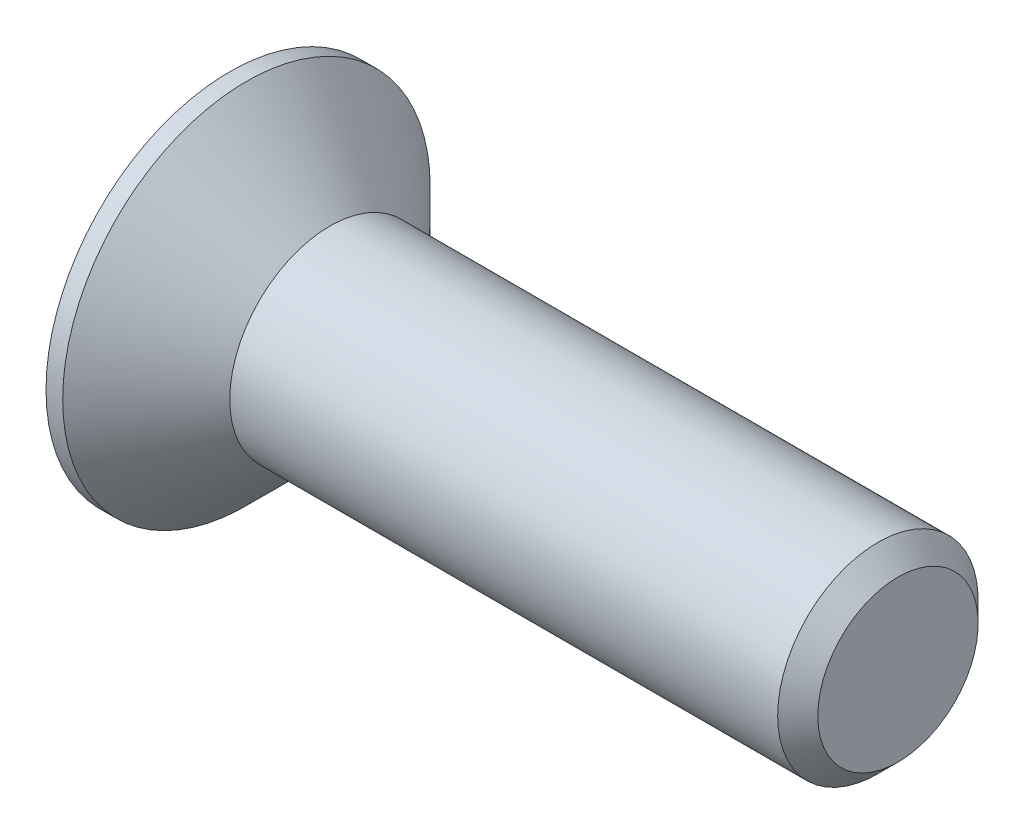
ISO-10303-21;
HEADER;
FILE_DESCRIPTION(('STEP AP214'),'2;1');
FILE_NAME('part.step','',(''),(''),'','','');
FILE_SCHEMA(('AUTOMOTIVE_DESIGN { 1 0 10303 214 1 1 1 1 }'));
ENDSEC;
DATA;
#1=APPLICATION_CONTEXT('core data for automotive mechanical design processes');
#2=APPLICATION_PROTOCOL_DEFINITION('international standard','automotive_design',2000,#1);
#3=PRODUCT_CONTEXT('',#1,'mechanical');
#4=PRODUCT('Part','Part','',(#3));
#5=PRODUCT_RELATED_PRODUCT_CATEGORY('part','',(#4));
#6=PRODUCT_DEFINITION_FORMATION('','',#4);
#7=PRODUCT_DEFINITION_CONTEXT('part definition',#1,'design');
#8=PRODUCT_DEFINITION('design','',#6,#7);
#9=PRODUCT_DEFINITION_SHAPE('','',#8);
#10=(LENGTH_UNIT() NAMED_UNIT(*) SI_UNIT(.MILLI.,.METRE.));
#11=(NAMED_UNIT(*) PLANE_ANGLE_UNIT() SI_UNIT($,.RADIAN.));
#12=(NAMED_UNIT(*) SI_UNIT($,.STERADIAN.) SOLID_ANGLE_UNIT());
#13=UNCERTAINTY_MEASURE_WITH_UNIT(LENGTH_MEASURE(1.E-05),#10,'distance_accuracy_value','');
#14=(GEOMETRIC_REPRESENTATION_CONTEXT(3) GLOBAL_UNCERTAINTY_ASSIGNED_CONTEXT((#13)) GLOBAL_UNIT_ASSIGNED_CONTEXT((#10,
#11,#12)) REPRESENTATION_CONTEXT('',''));
#15=CARTESIAN_POINT('',(0.,0.,0.));
#16=DIRECTION('',(0.,0.,1.));
#17=DIRECTION('',(1.,0.,0.));
#18=AXIS2_PLACEMENT_3D('',#15,#16,#17);
#19=CARTESIAN_POINT('',(0.,0.,0.));
#20=DIRECTION('',(-1.,0.,0.));
#21=DIRECTION('',(0.,0.,1.));
#22=AXIS2_PLACEMENT_3D('',#19,#20,#21);
#23=CONICAL_SURFACE('',#22,3.,0.78539816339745);
#24=CARTESIAN_POINT('',(-2.49999999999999,0.,0.));
#25=DIRECTION('',(-1.,0.,0.));
#26=DIRECTION('',(0.,0.,1.));
#27=AXIS2_PLACEMENT_3D('',#24,#25,#26);
#28=CIRCLE('',#27,5.5);
#29=CARTESIAN_POINT('',(-2.49999999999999,0.,5.5));
#30=VERTEX_POINT('',#29);
#31=EDGE_CURVE('E189',#30,#30,#28,.T.);
#32=ORIENTED_EDGE('',*,*,#31,.F.);
#33=EDGE_LOOP('',(#32));
#34=FACE_BOUND('',#33,.T.);
#35=CARTESIAN_POINT('',(0.,0.,0.));
#36=DIRECTION('',(-1.,0.,0.));
#37=DIRECTION('',(0.,0.,1.));
#38=AXIS2_PLACEMENT_3D('',#35,#36,#37);
#39=CIRCLE('',#38,3.);
#40=CARTESIAN_POINT('',(0.,0.,3.));
#41=VERTEX_POINT('',#40);
#42=EDGE_CURVE('E212',#41,#41,#39,.T.);
#43=ORIENTED_EDGE('',*,*,#42,.T.);
#44=EDGE_LOOP('',(#43));
#45=FACE_BOUND('',#44,.T.);
#46=ADVANCED_FACE('F33',(#34,#45),#23,.T.);
#47=CARTESIAN_POINT('',(-3.,0.,0.));
#48=DIRECTION('',(-1.,0.,0.));
#49=DIRECTION('',(0.,0.,1.));
#50=AXIS2_PLACEMENT_3D('',#47,#48,#49);
#51=CYLINDRICAL_SURFACE('',#50,3.);
#52=CARTESIAN_POINT('',(16.4,0.,0.));
#53=DIRECTION('',(-1.,0.,0.));
#54=DIRECTION('',(0.,0.,1.));
#55=AXIS2_PLACEMENT_3D('',#52,#53,#54);
#56=CIRCLE('',#55,3.);
#57=CARTESIAN_POINT('',(16.4,0.,3.));
#58=VERTEX_POINT('',#57);
#59=EDGE_CURVE('E41',#58,#58,#56,.T.);
#60=ORIENTED_EDGE('',*,*,#59,.T.);
#61=EDGE_LOOP('',(#60));
#62=FACE_BOUND('',#61,.T.);
#63=ORIENTED_EDGE('',*,*,#42,.F.);
#64=EDGE_LOOP('',(#63));
#65=FACE_BOUND('',#64,.T.);
#66=ADVANCED_FACE('F217',(#62,#65),#51,.T.);
#67=CARTESIAN_POINT('',(17.,0.,0.));
#68=DIRECTION('',(-1.,0.,0.));
#69=DIRECTION('',(0.,0.,1.));
#70=AXIS2_PLACEMENT_3D('',#67,#68,#69);
#71=PLANE('',#70);
#72=CARTESIAN_POINT('',(17.,0.,0.));
#73=DIRECTION('',(-1.,0.,0.));
#74=DIRECTION('',(0.,0.,1.));
#75=AXIS2_PLACEMENT_3D('',#72,#73,#74);
#76=CIRCLE('',#75,2.39999999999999);
#77=CARTESIAN_POINT('',(17.,0.,2.39999999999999));
#78=VERTEX_POINT('',#77);
#79=EDGE_CURVE('E11',#78,#78,#76,.F.);
#80=ORIENTED_EDGE('',*,*,#79,.T.);
#81=EDGE_LOOP('',(#80));
#82=FACE_BOUND('',#81,.T.);
#83=ADVANCED_FACE('F239',(#82),#71,.F.);
#84=CARTESIAN_POINT('',(-3.,5.5,0.));
#85=DIRECTION('',(1.,0.,0.));
#86=DIRECTION('',(0.,0.,-1.));
#87=AXIS2_PLACEMENT_3D('',#84,#85,#86);
#88=PLANE('',#87);
#89=DIRECTION('',(0.,0.,-1.));
#90=VECTOR('',#89,1.);
#91=CARTESIAN_POINT('',(-3.,0.825,-3.3));
#92=LINE('',#91,#90);
#93=CARTESIAN_POINT('',(-3.,0.825,-0.825));
#94=VERTEX_POINT('',#93);
#95=CARTESIAN_POINT('',(-3.,0.825,-3.3));
#96=VERTEX_POINT('',#95);
#97=EDGE_CURVE('E158',#94,#96,#92,.T.);
#98=ORIENTED_EDGE('',*,*,#97,.F.);
#99=DIRECTION('',(0.,-1.,0.));
#100=VECTOR('',#99,1.);
#101=CARTESIAN_POINT('',(-3.,0.825,-0.825));
#102=LINE('',#101,#100);
#103=CARTESIAN_POINT('',(-3.,3.3,-0.825));
#104=VERTEX_POINT('',#103);
#105=EDGE_CURVE('E48',#104,#94,#102,.T.);
#106=ORIENTED_EDGE('',*,*,#105,.F.);
#107=DIRECTION('',(0.,0.,-1.));
#108=VECTOR('',#107,1.);
#109=CARTESIAN_POINT('',(-3.,3.3,-0.825));
#110=LINE('',#109,#108);
#111=CARTESIAN_POINT('',(-3.,3.3,0.825));
#112=VERTEX_POINT('',#111);
#113=EDGE_CURVE('E185',#112,#104,#110,.T.);
#114=ORIENTED_EDGE('',*,*,#113,.F.);
#115=DIRECTION('',(0.,1.,0.));
#116=VECTOR('',#115,1.);
#117=CARTESIAN_POINT('',(-3.,3.3,0.825));
#118=LINE('',#117,#116);
#119=CARTESIAN_POINT('',(-3.,0.825,0.825));
#120=VERTEX_POINT('',#119);
#121=EDGE_CURVE('E183',#120,#112,#118,.T.);
#122=ORIENTED_EDGE('',*,*,#121,.F.);
#123=DIRECTION('',(0.,0.,-1.));
#124=VECTOR('',#123,1.);
#125=CARTESIAN_POINT('',(-3.,0.825,0.825));
#126=LINE('',#125,#124);
#127=CARTESIAN_POINT('',(-3.,0.825,3.3));
#128=VERTEX_POINT('',#127);
#129=EDGE_CURVE('E132',#128,#120,#126,.T.);
#130=ORIENTED_EDGE('',*,*,#129,.F.);
#131=DIRECTION('',(0.,1.,0.));
#132=VECTOR('',#131,1.);
#133=CARTESIAN_POINT('',(-3.,0.825,3.3));
#134=LINE('',#133,#132);
#135=CARTESIAN_POINT('',(-3.,-0.825,3.3));
#136=VERTEX_POINT('',#135);
#137=EDGE_CURVE('E179',#136,#128,#134,.T.);
#138=ORIENTED_EDGE('',*,*,#137,.F.);
#139=DIRECTION('',(0.,0.,1.));
#140=VECTOR('',#139,1.);
#141=CARTESIAN_POINT('',(-3.,-0.825,3.3));
#142=LINE('',#141,#140);
#143=CARTESIAN_POINT('',(-3.,-0.825,0.825));
#144=VERTEX_POINT('',#143);
#145=EDGE_CURVE('E176',#144,#136,#142,.T.);
#146=ORIENTED_EDGE('',*,*,#145,.F.);
#147=DIRECTION('',(0.,1.,0.));
#148=VECTOR('',#147,1.);
#149=CARTESIAN_POINT('',(-3.,-0.825,0.825));
#150=LINE('',#149,#148);
#151=CARTESIAN_POINT('',(-3.,-3.3,0.825));
#152=VERTEX_POINT('',#151);
#153=EDGE_CURVE('E173',#152,#144,#150,.T.);
#154=ORIENTED_EDGE('',*,*,#153,.F.);
#155=DIRECTION('',(0.,0.,1.));
#156=VECTOR('',#155,1.);
#157=CARTESIAN_POINT('',(-3.,-3.3,0.825));
#158=LINE('',#157,#156);
#159=CARTESIAN_POINT('',(-3.,-3.3,-0.825));
#160=VERTEX_POINT('',#159);
#161=EDGE_CURVE('E170',#160,#152,#158,.T.);
#162=ORIENTED_EDGE('',*,*,#161,.F.);
#163=DIRECTION('',(0.,-1.,0.));
#164=VECTOR('',#163,1.);
#165=CARTESIAN_POINT('',(-3.,-3.3,-0.825));
#166=LINE('',#165,#164);
#167=CARTESIAN_POINT('',(-3.,-0.825,-0.825));
#168=VERTEX_POINT('',#167);
#169=EDGE_CURVE('E167',#168,#160,#166,.T.);
#170=ORIENTED_EDGE('',*,*,#169,.F.);
#171=DIRECTION('',(0.,0.,1.));
#172=VECTOR('',#171,1.);
#173=CARTESIAN_POINT('',(-3.,-0.825,-0.825));
#174=LINE('',#173,#172);
#175=CARTESIAN_POINT('',(-3.,-0.825,-3.3));
#176=VERTEX_POINT('',#175);
#177=EDGE_CURVE('E164',#176,#168,#174,.T.);
#178=ORIENTED_EDGE('',*,*,#177,.F.);
#179=DIRECTION('',(0.,-1.,0.));
#180=VECTOR('',#179,1.);
#181=CARTESIAN_POINT('',(-3.,-0.825,-3.3));
#182=LINE('',#181,#180);
#183=EDGE_CURVE('E161',#96,#176,#182,.T.);
#184=ORIENTED_EDGE('',*,*,#183,.F.);
#185=EDGE_LOOP('',(#98,#106,#114,#122,#130,#138,#146,#154,#162,#170,#178,#184));
#186=FACE_BOUND('',#185,.T.);
#187=CARTESIAN_POINT('',(-3.,0.,0.));
#188=DIRECTION('',(-1.,0.,0.));
#189=DIRECTION('',(0.,0.,1.));
#190=AXIS2_PLACEMENT_3D('',#187,#188,#189);
#191=CIRCLE('',#190,5.5);
#192=CARTESIAN_POINT('',(-3.,0.,5.5));
#193=VERTEX_POINT('',#192);
#194=EDGE_CURVE('E209',#193,#193,#191,.T.);
#195=ORIENTED_EDGE('',*,*,#194,.T.);
#196=EDGE_LOOP('',(#195));
#197=FACE_BOUND('',#196,.T.);
#198=ADVANCED_FACE('F230',(#186,#197),#88,.F.);
#199=CARTESIAN_POINT('',(-3.,0.,0.));
#200=DIRECTION('',(-1.,0.,0.));
#201=DIRECTION('',(0.,0.,1.));
#202=AXIS2_PLACEMENT_3D('',#199,#200,#201);
#203=CYLINDRICAL_SURFACE('',#202,5.5);
#204=ORIENTED_EDGE('',*,*,#194,.F.);
#205=EDGE_LOOP('',(#204));
#206=FACE_BOUND('',#205,.T.);
#207=ORIENTED_EDGE('',*,*,#31,.T.);
#208=EDGE_LOOP('',(#207));
#209=FACE_BOUND('',#208,.T.);
#210=ADVANCED_FACE('F222',(#206,#209),#203,.T.);
#211=CARTESIAN_POINT('',(16.4,0.,0.));
#212=DIRECTION('',(-1.,0.,0.));
#213=DIRECTION('',(0.,0.,1.));
#214=AXIS2_PLACEMENT_3D('',#211,#212,#213);
#215=CONICAL_SURFACE('',#214,3.,0.785398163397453);
#216=ORIENTED_EDGE('',*,*,#79,.F.);
#217=EDGE_LOOP('',(#216));
#218=FACE_BOUND('',#217,.T.);
#219=ORIENTED_EDGE('',*,*,#59,.F.);
#220=EDGE_LOOP('',(#219));
#221=FACE_BOUND('',#220,.T.);
#222=ADVANCED_FACE('F35',(#218,#221),#215,.T.);
#223=CARTESIAN_POINT('',(-0.5,0.825,-0.825));
#224=DIRECTION('',(0.,0.,-1.));
#225=DIRECTION('',(-1.,0.,0.));
#226=AXIS2_PLACEMENT_3D('',#223,#224,#225);
#227=PLANE('',#226);
#228=ORIENTED_EDGE('',*,*,#105,.T.);
#229=DIRECTION('',(-1.,0.,0.));
#230=VECTOR('',#229,1.);
#231=CARTESIAN_POINT('',(-0.5,0.825,-0.825));
#232=LINE('',#231,#230);
#233=CARTESIAN_POINT('',(-0.5,0.825,-0.825));
#234=VERTEX_POINT('',#233);
#235=EDGE_CURVE('E96',#234,#94,#232,.T.);
#236=ORIENTED_EDGE('',*,*,#235,.F.);
#237=DIRECTION('',(0.,-1.,0.));
#238=VECTOR('',#237,1.);
#239=CARTESIAN_POINT('',(-0.5,0.825,-0.825));
#240=LINE('',#239,#238);
#241=CARTESIAN_POINT('',(-0.5,3.3,-0.825));
#242=VERTEX_POINT('',#241);
#243=EDGE_CURVE('E187',#242,#234,#240,.T.);
#244=ORIENTED_EDGE('',*,*,#243,.F.);
#245=DIRECTION('',(-1.,0.,0.));
#246=VECTOR('',#245,1.);
#247=CARTESIAN_POINT('',(-0.5,3.3,-0.825));
#248=LINE('',#247,#246);
#249=EDGE_CURVE('E56',#242,#104,#248,.T.);
#250=ORIENTED_EDGE('',*,*,#249,.T.);
#251=EDGE_LOOP('',(#228,#236,#244,#250));
#252=FACE_BOUND('',#251,.T.);
#253=ADVANCED_FACE('F221',(#252),#227,.F.);
#254=CARTESIAN_POINT('',(-0.5,3.3,-0.825));
#255=DIRECTION('',(0.,1.,0.));
#256=DIRECTION('',(-1.,0.,0.));
#257=AXIS2_PLACEMENT_3D('',#254,#255,#256);
#258=PLANE('',#257);
#259=ORIENTED_EDGE('',*,*,#113,.T.);
#260=ORIENTED_EDGE('',*,*,#249,.F.);
#261=DIRECTION('',(0.,0.,-1.));
#262=VECTOR('',#261,1.);
#263=CARTESIAN_POINT('',(-0.5,3.3,-0.825));
#264=LINE('',#263,#262);
#265=CARTESIAN_POINT('',(-0.5,3.3,0.825));
#266=VERTEX_POINT('',#265);
#267=EDGE_CURVE('E144',#266,#242,#264,.T.);
#268=ORIENTED_EDGE('',*,*,#267,.F.);
#269=DIRECTION('',(-1.,0.,0.));
#270=VECTOR('',#269,1.);
#271=CARTESIAN_POINT('',(-0.5,3.3,0.825));
#272=LINE('',#271,#270);
#273=EDGE_CURVE('E136',#266,#112,#272,.T.);
#274=ORIENTED_EDGE('',*,*,#273,.T.);
#275=EDGE_LOOP('',(#259,#260,#268,#274));
#276=FACE_BOUND('',#275,.T.);
#277=ADVANCED_FACE('F228',(#276),#258,.F.);
#278=CARTESIAN_POINT('',(-0.5,3.3,0.825));
#279=DIRECTION('',(0.,0.,1.));
#280=DIRECTION('',(1.,0.,0.));
#281=AXIS2_PLACEMENT_3D('',#278,#279,#280);
#282=PLANE('',#281);
#283=ORIENTED_EDGE('',*,*,#121,.T.);
#284=ORIENTED_EDGE('',*,*,#273,.F.);
#285=DIRECTION('',(0.,1.,0.));
#286=VECTOR('',#285,1.);
#287=CARTESIAN_POINT('',(-0.5,3.3,0.825));
#288=LINE('',#287,#286);
#289=CARTESIAN_POINT('',(-0.5,0.825,0.825));
#290=VERTEX_POINT('',#289);
#291=EDGE_CURVE('E140',#290,#266,#288,.T.);
#292=ORIENTED_EDGE('',*,*,#291,.F.);
#293=DIRECTION('',(-1.,0.,0.));
#294=VECTOR('',#293,1.);
#295=CARTESIAN_POINT('',(-0.5,0.825,0.825));
#296=LINE('',#295,#294);
#297=EDGE_CURVE('E125',#290,#120,#296,.T.);
#298=ORIENTED_EDGE('',*,*,#297,.T.);
#299=EDGE_LOOP('',(#283,#284,#292,#298));
#300=FACE_BOUND('',#299,.T.);
#301=ADVANCED_FACE('F141',(#300),#282,.F.);
#302=CARTESIAN_POINT('',(-0.5,0.825,0.825));
#303=DIRECTION('',(0.,1.,0.));
#304=DIRECTION('',(-1.,0.,0.));
#305=AXIS2_PLACEMENT_3D('',#302,#303,#304);
#306=PLANE('',#305);
#307=ORIENTED_EDGE('',*,*,#129,.T.);
#308=ORIENTED_EDGE('',*,*,#297,.F.);
#309=DIRECTION('',(0.,0.,-1.));
#310=VECTOR('',#309,1.);
#311=CARTESIAN_POINT('',(-0.5,0.825,0.825));
#312=LINE('',#311,#310);
#313=CARTESIAN_POINT('',(-0.5,0.825,3.3));
#314=VERTEX_POINT('',#313);
#315=EDGE_CURVE('E129',#314,#290,#312,.T.);
#316=ORIENTED_EDGE('',*,*,#315,.F.);
#317=DIRECTION('',(-1.,0.,0.));
#318=VECTOR('',#317,1.);
#319=CARTESIAN_POINT('',(-0.5,0.825,3.3));
#320=LINE('',#319,#318);
#321=EDGE_CURVE('E137',#314,#128,#320,.T.);
#322=ORIENTED_EDGE('',*,*,#321,.T.);
#323=EDGE_LOOP('',(#307,#308,#316,#322));
#324=FACE_BOUND('',#323,.T.);
#325=ADVANCED_FACE('F127',(#324),#306,.F.);
#326=CARTESIAN_POINT('',(-0.5,0.825,3.3));
#327=DIRECTION('',(0.,0.,1.));
#328=DIRECTION('',(1.,0.,0.));
#329=AXIS2_PLACEMENT_3D('',#326,#327,#328);
#330=PLANE('',#329);
#331=ORIENTED_EDGE('',*,*,#137,.T.);
#332=ORIENTED_EDGE('',*,*,#321,.F.);
#333=DIRECTION('',(0.,1.,0.));
#334=VECTOR('',#333,1.);
#335=CARTESIAN_POINT('',(-0.5,0.825,3.3));
#336=LINE('',#335,#334);
#337=CARTESIAN_POINT('',(-0.5,-0.825,3.3));
#338=VERTEX_POINT('',#337);
#339=EDGE_CURVE('E150',#338,#314,#336,.T.);
#340=ORIENTED_EDGE('',*,*,#339,.F.);
#341=DIRECTION('',(-1.,0.,0.));
#342=VECTOR('',#341,1.);
#343=CARTESIAN_POINT('',(-0.5,-0.825,3.3));
#344=LINE('',#343,#342);
#345=EDGE_CURVE('E192',#338,#136,#344,.T.);
#346=ORIENTED_EDGE('',*,*,#345,.T.);
#347=EDGE_LOOP('',(#331,#332,#340,#346));
#348=FACE_BOUND('',#347,.T.);
#349=ADVANCED_FACE('F277',(#348),#330,.F.);
#350=CARTESIAN_POINT('',(-0.5,-0.825,3.3));
#351=DIRECTION('',(0.,-1.,0.));
#352=DIRECTION('',(1.,0.,0.));
#353=AXIS2_PLACEMENT_3D('',#350,#351,#352);
#354=PLANE('',#353);
#355=ORIENTED_EDGE('',*,*,#145,.T.);
#356=ORIENTED_EDGE('',*,*,#345,.F.);
#357=DIRECTION('',(0.,0.,1.));
#358=VECTOR('',#357,1.);
#359=CARTESIAN_POINT('',(-0.5,-0.825,3.3));
#360=LINE('',#359,#358);
#361=CARTESIAN_POINT('',(-0.5,-0.825,0.825));
#362=VERTEX_POINT('',#361);
#363=EDGE_CURVE('E152',#362,#338,#360,.T.);
#364=ORIENTED_EDGE('',*,*,#363,.F.);
#365=DIRECTION('',(-1.,0.,0.));
#366=VECTOR('',#365,1.);
#367=CARTESIAN_POINT('',(-0.5,-0.825,0.825));
#368=LINE('',#367,#366);
#369=EDGE_CURVE('E194',#362,#144,#368,.T.);
#370=ORIENTED_EDGE('',*,*,#369,.T.);
#371=EDGE_LOOP('',(#355,#356,#364,#370));
#372=FACE_BOUND('',#371,.T.);
#373=ADVANCED_FACE('F273',(#372),#354,.F.);
#374=CARTESIAN_POINT('',(-0.5,-0.825,0.825));
#375=DIRECTION('',(0.,0.,1.));
#376=DIRECTION('',(1.,0.,0.));
#377=AXIS2_PLACEMENT_3D('',#374,#375,#376);
#378=PLANE('',#377);
#379=ORIENTED_EDGE('',*,*,#153,.T.);
#380=ORIENTED_EDGE('',*,*,#369,.F.);
#381=DIRECTION('',(0.,1.,0.));
#382=VECTOR('',#381,1.);
#383=CARTESIAN_POINT('',(-0.5,-0.825,0.825));
#384=LINE('',#383,#382);
#385=CARTESIAN_POINT('',(-0.5,-3.3,0.825));
#386=VERTEX_POINT('',#385);
#387=EDGE_CURVE('E422',#386,#362,#384,.T.);
#388=ORIENTED_EDGE('',*,*,#387,.F.);
#389=DIRECTION('',(-1.,0.,0.));
#390=VECTOR('',#389,1.);
#391=CARTESIAN_POINT('',(-0.5,-3.3,0.825));
#392=LINE('',#391,#390);
#393=EDGE_CURVE('E196',#386,#152,#392,.T.);
#394=ORIENTED_EDGE('',*,*,#393,.T.);
#395=EDGE_LOOP('',(#379,#380,#388,#394));
#396=FACE_BOUND('',#395,.T.);
#397=ADVANCED_FACE('F269',(#396),#378,.F.);
#398=CARTESIAN_POINT('',(-0.5,-3.3,0.825));
#399=DIRECTION('',(0.,-1.,0.));
#400=DIRECTION('',(1.,0.,0.));
#401=AXIS2_PLACEMENT_3D('',#398,#399,#400);
#402=PLANE('',#401);
#403=ORIENTED_EDGE('',*,*,#161,.T.);
#404=ORIENTED_EDGE('',*,*,#393,.F.);
#405=DIRECTION('',(0.,0.,1.));
#406=VECTOR('',#405,1.);
#407=CARTESIAN_POINT('',(-0.5,-3.3,0.825));
#408=LINE('',#407,#406);
#409=CARTESIAN_POINT('',(-0.5,-3.3,-0.825));
#410=VERTEX_POINT('',#409);
#411=EDGE_CURVE('E419',#410,#386,#408,.T.);
#412=ORIENTED_EDGE('',*,*,#411,.F.);
#413=DIRECTION('',(-1.,0.,0.));
#414=VECTOR('',#413,1.);
#415=CARTESIAN_POINT('',(-0.5,-3.3,-0.825));
#416=LINE('',#415,#414);
#417=EDGE_CURVE('E198',#410,#160,#416,.T.);
#418=ORIENTED_EDGE('',*,*,#417,.T.);
#419=EDGE_LOOP('',(#403,#404,#412,#418));
#420=FACE_BOUND('',#419,.T.);
#421=ADVANCED_FACE('F265',(#420),#402,.F.);
#422=CARTESIAN_POINT('',(-0.5,-3.3,-0.825));
#423=DIRECTION('',(0.,0.,-1.));
#424=DIRECTION('',(-1.,0.,0.));
#425=AXIS2_PLACEMENT_3D('',#422,#423,#424);
#426=PLANE('',#425);
#427=ORIENTED_EDGE('',*,*,#169,.T.);
#428=ORIENTED_EDGE('',*,*,#417,.F.);
#429=DIRECTION('',(0.,-1.,0.));
#430=VECTOR('',#429,1.);
#431=CARTESIAN_POINT('',(-0.5,-3.3,-0.825));
#432=LINE('',#431,#430);
#433=CARTESIAN_POINT('',(-0.5,-0.825,-0.825));
#434=VERTEX_POINT('',#433);
#435=EDGE_CURVE('E416',#434,#410,#432,.T.);
#436=ORIENTED_EDGE('',*,*,#435,.F.);
#437=DIRECTION('',(-1.,0.,0.));
#438=VECTOR('',#437,1.);
#439=CARTESIAN_POINT('',(-0.5,-0.825,-0.825));
#440=LINE('',#439,#438);
#441=EDGE_CURVE('E200',#434,#168,#440,.T.);
#442=ORIENTED_EDGE('',*,*,#441,.T.);
#443=EDGE_LOOP('',(#427,#428,#436,#442));
#444=FACE_BOUND('',#443,.T.);
#445=ADVANCED_FACE('F261',(#444),#426,.F.);
#446=CARTESIAN_POINT('',(-0.5,-0.825,-0.825));
#447=DIRECTION('',(0.,-1.,0.));
#448=DIRECTION('',(1.,0.,0.));
#449=AXIS2_PLACEMENT_3D('',#446,#447,#448);
#450=PLANE('',#449);
#451=ORIENTED_EDGE('',*,*,#177,.T.);
#452=ORIENTED_EDGE('',*,*,#441,.F.);
#453=DIRECTION('',(0.,0.,1.));
#454=VECTOR('',#453,1.);
#455=CARTESIAN_POINT('',(-0.5,-0.825,-0.825));
#456=LINE('',#455,#454);
#457=CARTESIAN_POINT('',(-0.5,-0.825,-3.3));
#458=VERTEX_POINT('',#457);
#459=EDGE_CURVE('E413',#458,#434,#456,.T.);
#460=ORIENTED_EDGE('',*,*,#459,.F.);
#461=DIRECTION('',(-1.,0.,0.));
#462=VECTOR('',#461,1.);
#463=CARTESIAN_POINT('',(-0.5,-0.825,-3.3));
#464=LINE('',#463,#462);
#465=EDGE_CURVE('E202',#458,#176,#464,.T.);
#466=ORIENTED_EDGE('',*,*,#465,.T.);
#467=EDGE_LOOP('',(#451,#452,#460,#466));
#468=FACE_BOUND('',#467,.T.);
#469=ADVANCED_FACE('F257',(#468),#450,.F.);
#470=CARTESIAN_POINT('',(-0.5,-0.825,-3.3));
#471=DIRECTION('',(0.,0.,-1.));
#472=DIRECTION('',(-1.,0.,0.));
#473=AXIS2_PLACEMENT_3D('',#470,#471,#472);
#474=PLANE('',#473);
#475=ORIENTED_EDGE('',*,*,#183,.T.);
#476=ORIENTED_EDGE('',*,*,#465,.F.);
#477=DIRECTION('',(0.,-1.,0.));
#478=VECTOR('',#477,1.);
#479=CARTESIAN_POINT('',(-0.5,-0.825,-3.3));
#480=LINE('',#479,#478);
#481=CARTESIAN_POINT('',(-0.5,0.825,-3.3));
#482=VERTEX_POINT('',#481);
#483=EDGE_CURVE('E408',#482,#458,#480,.T.);
#484=ORIENTED_EDGE('',*,*,#483,.F.);
#485=DIRECTION('',(-1.,0.,0.));
#486=VECTOR('',#485,1.);
#487=CARTESIAN_POINT('',(-0.5,0.825,-3.3));
#488=LINE('',#487,#486);
#489=EDGE_CURVE('E204',#482,#96,#488,.T.);
#490=ORIENTED_EDGE('',*,*,#489,.T.);
#491=EDGE_LOOP('',(#475,#476,#484,#490));
#492=FACE_BOUND('',#491,.T.);
#493=ADVANCED_FACE('F253',(#492),#474,.F.);
#494=CARTESIAN_POINT('',(-0.5,0.825,-3.3));
#495=DIRECTION('',(0.,1.,0.));
#496=DIRECTION('',(-1.,0.,0.));
#497=AXIS2_PLACEMENT_3D('',#494,#495,#496);
#498=PLANE('',#497);
#499=ORIENTED_EDGE('',*,*,#97,.T.);
#500=ORIENTED_EDGE('',*,*,#489,.F.);
#501=DIRECTION('',(0.,0.,-1.));
#502=VECTOR('',#501,1.);
#503=CARTESIAN_POINT('',(-0.5,0.825,-3.3));
#504=LINE('',#503,#502);
#505=EDGE_CURVE('E406',#234,#482,#504,.T.);
#506=ORIENTED_EDGE('',*,*,#505,.F.);
#507=ORIENTED_EDGE('',*,*,#235,.T.);
#508=EDGE_LOOP('',(#499,#500,#506,#507));
#509=FACE_BOUND('',#508,.T.);
#510=ADVANCED_FACE('F250',(#509),#498,.F.);
#511=CARTESIAN_POINT('',(-0.5,0.,0.));
#512=DIRECTION('',(1.,0.,0.));
#513=DIRECTION('',(0.,0.,-1.));
#514=AXIS2_PLACEMENT_3D('',#511,#512,#513);
#515=PLANE('',#514);
#516=ORIENTED_EDGE('',*,*,#243,.T.);
#517=ORIENTED_EDGE('',*,*,#505,.T.);
#518=ORIENTED_EDGE('',*,*,#483,.T.);
#519=ORIENTED_EDGE('',*,*,#459,.T.);
#520=ORIENTED_EDGE('',*,*,#435,.T.);
#521=ORIENTED_EDGE('',*,*,#411,.T.);
#522=ORIENTED_EDGE('',*,*,#387,.T.);
#523=ORIENTED_EDGE('',*,*,#363,.T.);
#524=ORIENTED_EDGE('',*,*,#339,.T.);
#525=ORIENTED_EDGE('',*,*,#315,.T.);
#526=ORIENTED_EDGE('',*,*,#291,.T.);
#527=ORIENTED_EDGE('',*,*,#267,.T.);
#528=EDGE_LOOP('',(#516,#517,#518,#519,#520,#521,#522,#523,#524,#525,#526,#527));
#529=FACE_BOUND('',#528,.T.);
#530=ADVANCED_FACE('F147',(#529),#515,.F.);
#531=CLOSED_SHELL('',(#46,#66,#83,#198,#210,#222,#253,#277,#301,#325,#349,#373,#397,#421,#445,
#469,#493,#510,#530));
#532=MANIFOLD_SOLID_BREP('B2',#531);
#533=ADVANCED_BREP_SHAPE_REPRESENTATION('',(#18,#532),#14);
#534=SHAPE_DEFINITION_REPRESENTATION(#9,#533);
ENDSEC;
END-ISO-10303-21;
